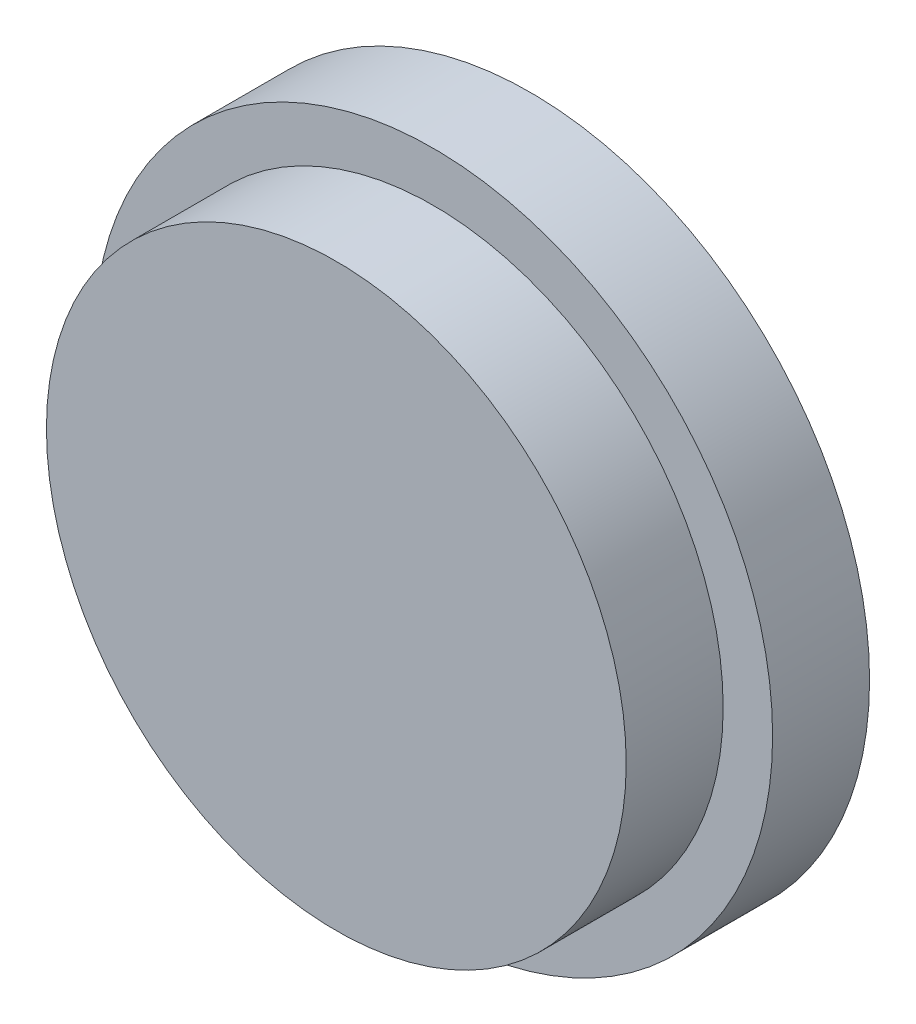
ISO-10303-21;
HEADER;
FILE_DESCRIPTION(('STEP AP214'),'2;1');
FILE_NAME('part.step','',(''),(''),'','','');
FILE_SCHEMA(('AUTOMOTIVE_DESIGN { 1 0 10303 214 1 1 1 1 }'));
ENDSEC;
DATA;
#1=APPLICATION_CONTEXT('core data for automotive mechanical design processes');
#2=APPLICATION_PROTOCOL_DEFINITION('international standard','automotive_design',2000,#1);
#3=PRODUCT_CONTEXT('',#1,'mechanical');
#4=PRODUCT('Part','Part','',(#3));
#5=PRODUCT_RELATED_PRODUCT_CATEGORY('part','',(#4));
#6=PRODUCT_DEFINITION_FORMATION('','',#4);
#7=PRODUCT_DEFINITION_CONTEXT('part definition',#1,'design');
#8=PRODUCT_DEFINITION('design','',#6,#7);
#9=PRODUCT_DEFINITION_SHAPE('','',#8);
#10=(LENGTH_UNIT() NAMED_UNIT(*) SI_UNIT(.MILLI.,.METRE.));
#11=(NAMED_UNIT(*) PLANE_ANGLE_UNIT() SI_UNIT($,.RADIAN.));
#12=(NAMED_UNIT(*) SI_UNIT($,.STERADIAN.) SOLID_ANGLE_UNIT());
#13=UNCERTAINTY_MEASURE_WITH_UNIT(LENGTH_MEASURE(1.E-05),#10,'distance_accuracy_value','');
#14=(GEOMETRIC_REPRESENTATION_CONTEXT(3) GLOBAL_UNCERTAINTY_ASSIGNED_CONTEXT((#13)) GLOBAL_UNIT_ASSIGNED_CONTEXT((#10,
#11,#12)) REPRESENTATION_CONTEXT('',''));
#15=CARTESIAN_POINT('',(0.,0.,0.));
#16=DIRECTION('',(0.,0.,1.));
#17=DIRECTION('',(1.,0.,0.));
#18=AXIS2_PLACEMENT_3D('',#15,#16,#17);
#19=CARTESIAN_POINT('',(0.,0.,12.7));
#20=DIRECTION('',(0.,0.,-1.));
#21=DIRECTION('',(-1.,0.,0.));
#22=AXIS2_PLACEMENT_3D('',#19,#20,#21);
#23=CYLINDRICAL_SURFACE('',#22,44.45);
#24=CARTESIAN_POINT('',(0.,0.,12.7));
#25=DIRECTION('',(0.,0.,1.));
#26=DIRECTION('',(1.,0.,0.));
#27=AXIS2_PLACEMENT_3D('',#24,#25,#26);
#28=CIRCLE('',#27,44.45);
#29=CARTESIAN_POINT('',(44.45,0.,12.7));
#30=VERTEX_POINT('',#29);
#31=EDGE_CURVE('E49',#30,#30,#28,.T.);
#32=ORIENTED_EDGE('',*,*,#31,.F.);
#33=EDGE_LOOP('',(#32));
#34=FACE_BOUND('',#33,.T.);
#35=CARTESIAN_POINT('',(0.,0.,0.));
#36=DIRECTION('',(0.,0.,1.));
#37=DIRECTION('',(1.,0.,0.));
#38=AXIS2_PLACEMENT_3D('',#35,#36,#37);
#39=CIRCLE('',#38,44.45);
#40=CARTESIAN_POINT('',(44.45,0.,0.));
#41=VERTEX_POINT('',#40);
#42=EDGE_CURVE('E45',#41,#41,#39,.T.);
#43=ORIENTED_EDGE('',*,*,#42,.T.);
#44=EDGE_LOOP('',(#43));
#45=FACE_BOUND('',#44,.T.);
#46=ADVANCED_FACE('F42',(#34,#45),#23,.T.);
#47=CARTESIAN_POINT('',(0.,0.,12.7));
#48=DIRECTION('',(0.,0.,1.));
#49=DIRECTION('',(1.,0.,0.));
#50=AXIS2_PLACEMENT_3D('',#47,#48,#49);
#51=PLANE('',#50);
#52=CARTESIAN_POINT('',(0.,0.,12.7));
#53=DIRECTION('',(0.,0.,1.));
#54=DIRECTION('',(1.,0.,0.));
#55=AXIS2_PLACEMENT_3D('',#52,#53,#54);
#56=CIRCLE('',#55,37.973);
#57=CARTESIAN_POINT('',(37.973,0.,12.7));
#58=VERTEX_POINT('',#57);
#59=EDGE_CURVE('E12',#58,#58,#56,.T.);
#60=ORIENTED_EDGE('',*,*,#59,.F.);
#61=EDGE_LOOP('',(#60));
#62=FACE_BOUND('',#61,.T.);
#63=ORIENTED_EDGE('',*,*,#31,.T.);
#64=EDGE_LOOP('',(#63));
#65=FACE_BOUND('',#64,.T.);
#66=ADVANCED_FACE('F66',(#62,#65),#51,.T.);
#67=CARTESIAN_POINT('',(0.,0.,0.));
#68=DIRECTION('',(0.,0.,1.));
#69=DIRECTION('',(1.,0.,0.));
#70=AXIS2_PLACEMENT_3D('',#67,#68,#69);
#71=PLANE('',#70);
#72=ORIENTED_EDGE('',*,*,#42,.F.);
#73=EDGE_LOOP('',(#72));
#74=FACE_BOUND('',#73,.T.);
#75=ADVANCED_FACE('F63',(#74),#71,.F.);
#76=CARTESIAN_POINT('',(0.,0.,25.4));
#77=DIRECTION('',(0.,0.,-1.));
#78=DIRECTION('',(-1.,0.,0.));
#79=AXIS2_PLACEMENT_3D('',#76,#77,#78);
#80=CYLINDRICAL_SURFACE('',#79,37.973);
#81=CARTESIAN_POINT('',(0.,0.,25.4));
#82=DIRECTION('',(0.,0.,1.));
#83=DIRECTION('',(1.,0.,0.));
#84=AXIS2_PLACEMENT_3D('',#81,#82,#83);
#85=CIRCLE('',#84,37.973);
#86=CARTESIAN_POINT('',(37.973,0.,25.4));
#87=VERTEX_POINT('',#86);
#88=EDGE_CURVE('E55',#87,#87,#85,.T.);
#89=ORIENTED_EDGE('',*,*,#88,.F.);
#90=EDGE_LOOP('',(#89));
#91=FACE_BOUND('',#90,.T.);
#92=ORIENTED_EDGE('',*,*,#59,.T.);
#93=EDGE_LOOP('',(#92));
#94=FACE_BOUND('',#93,.T.);
#95=ADVANCED_FACE('F65',(#91,#94),#80,.T.);
#96=CARTESIAN_POINT('',(0.,0.,25.4));
#97=DIRECTION('',(0.,0.,1.));
#98=DIRECTION('',(1.,0.,0.));
#99=AXIS2_PLACEMENT_3D('',#96,#97,#98);
#100=PLANE('',#99);
#101=ORIENTED_EDGE('',*,*,#88,.T.);
#102=EDGE_LOOP('',(#101));
#103=FACE_BOUND('',#102,.T.);
#104=ADVANCED_FACE('F71',(#103),#100,.T.);
#105=CLOSED_SHELL('',(#46,#66,#75,#95,#104));
#106=MANIFOLD_SOLID_BREP('B2',#105);
#107=ADVANCED_BREP_SHAPE_REPRESENTATION('',(#18,#106),#14);
#108=SHAPE_DEFINITION_REPRESENTATION(#9,#107);
ENDSEC;
END-ISO-10303-21;
